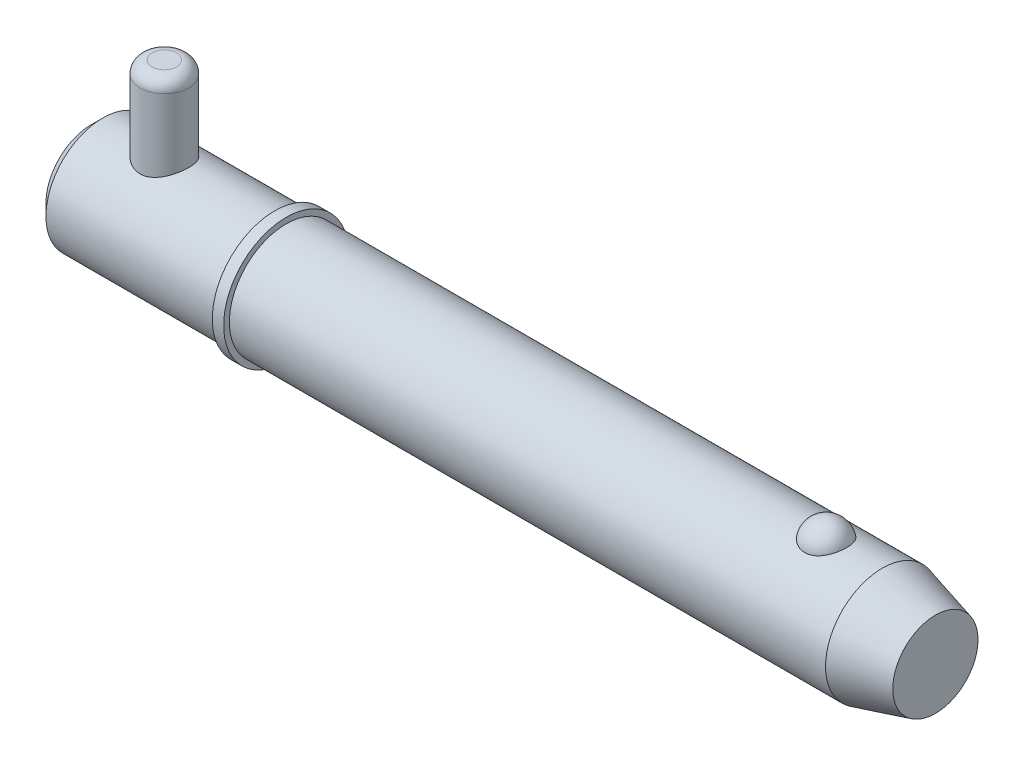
ISO-10303-21;
HEADER;
FILE_DESCRIPTION(('STEP AP214'),'2;1');
FILE_NAME('part.step','',(''),(''),'','','');
FILE_SCHEMA(('AUTOMOTIVE_DESIGN { 1 0 10303 214 1 1 1 1 }'));
ENDSEC;
DATA;
#1=APPLICATION_CONTEXT('core data for automotive mechanical design processes');
#2=APPLICATION_PROTOCOL_DEFINITION('international standard','automotive_design',2000,#1);
#3=PRODUCT_CONTEXT('',#1,'mechanical');
#4=PRODUCT('Part','Part','',(#3));
#5=PRODUCT_RELATED_PRODUCT_CATEGORY('part','',(#4));
#6=PRODUCT_DEFINITION_FORMATION('','',#4);
#7=PRODUCT_DEFINITION_CONTEXT('part definition',#1,'design');
#8=PRODUCT_DEFINITION('design','',#6,#7);
#9=PRODUCT_DEFINITION_SHAPE('','',#8);
#10=(LENGTH_UNIT() NAMED_UNIT(*) SI_UNIT(.MILLI.,.METRE.));
#11=(NAMED_UNIT(*) PLANE_ANGLE_UNIT() SI_UNIT($,.RADIAN.));
#12=(NAMED_UNIT(*) SI_UNIT($,.STERADIAN.) SOLID_ANGLE_UNIT());
#13=UNCERTAINTY_MEASURE_WITH_UNIT(LENGTH_MEASURE(1.E-05),#10,'distance_accuracy_value','');
#14=(GEOMETRIC_REPRESENTATION_CONTEXT(3) GLOBAL_UNCERTAINTY_ASSIGNED_CONTEXT((#13)) GLOBAL_UNIT_ASSIGNED_CONTEXT((#10,
#11,#12)) REPRESENTATION_CONTEXT('',''));
#15=CARTESIAN_POINT('',(0.,0.,0.));
#16=DIRECTION('',(0.,0.,1.));
#17=DIRECTION('',(1.,0.,0.));
#18=AXIS2_PLACEMENT_3D('',#15,#16,#17);
#19=CARTESIAN_POINT('',(14.28,26.985,0.));
#20=DIRECTION('',(0.,-1.,0.));
#21=DIRECTION('',(0.,0.,-1.));
#22=AXIS2_PLACEMENT_3D('',#19,#20,#21);
#23=CYLINDRICAL_SURFACE('',#22,4.76);
#24=CARTESIAN_POINT('',(14.28,-8.73500000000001,0.));
#25=DIRECTION('',(0.,1.,0.));
#26=DIRECTION('',(0.,0.,1.));
#27=AXIS2_PLACEMENT_3D('',#24,#25,#26);
#28=CIRCLE('',#27,4.76);
#29=CARTESIAN_POINT('',(14.28,-8.73500000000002,-4.76));
#30=VERTEX_POINT('',#29);
#31=EDGE_CURVE('P0_E25',#30,#30,#28,.T.);
#32=CARTESIAN_POINT('',(14.28,24.605,0.));
#33=DIRECTION('',(0.,1.,0.));
#34=DIRECTION('',(0.,0.,1.));
#35=AXIS2_PLACEMENT_3D('',#32,#33,#34);
#36=CIRCLE('',#35,4.76);
#37=CARTESIAN_POINT('',(14.28,24.605,-4.76));
#38=VERTEX_POINT('',#37);
#39=EDGE_CURVE('P0_E29',#38,#38,#36,.F.);
#40=CARTESIAN_POINT('',(14.28,-8.73500000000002,-4.76));
#41=CARTESIAN_POINT('',(14.28,-8.38770833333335,-4.76));
#42=CARTESIAN_POINT('',(14.28,-8.04041666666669,-4.76));
#43=CARTESIAN_POINT('',(14.28,-7.34583333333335,-4.76));
#44=CARTESIAN_POINT('',(14.28,-6.99854166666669,-4.76));
#45=CARTESIAN_POINT('',(14.28,-6.30395833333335,-4.76));
#46=CARTESIAN_POINT('',(14.28,-5.95666666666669,-4.76));
#47=CARTESIAN_POINT('',(14.28,-5.26208333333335,-4.76));
#48=CARTESIAN_POINT('',(14.28,-4.91479166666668,-4.76));
#49=CARTESIAN_POINT('',(14.28,-4.22020833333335,-4.76));
#50=CARTESIAN_POINT('',(14.28,-3.87291666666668,-4.76));
#51=CARTESIAN_POINT('',(14.28,-3.17833333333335,-4.76));
#52=CARTESIAN_POINT('',(14.28,-2.83104166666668,-4.76));
#53=CARTESIAN_POINT('',(14.28,-2.13645833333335,-4.76));
#54=CARTESIAN_POINT('',(14.28,-1.78916666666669,-4.76));
#55=CARTESIAN_POINT('',(14.28,-1.09458333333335,-4.76));
#56=CARTESIAN_POINT('',(14.28,-0.747291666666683,-4.76));
#57=CARTESIAN_POINT('',(14.28,-0.052708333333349,-4.76));
#58=CARTESIAN_POINT('',(14.28,0.294583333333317,-4.76));
#59=CARTESIAN_POINT('',(14.28,0.989166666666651,-4.76));
#60=CARTESIAN_POINT('',(14.28,1.33645833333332,-4.76));
#61=CARTESIAN_POINT('',(14.28,2.03104166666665,-4.76));
#62=CARTESIAN_POINT('',(14.28,2.37833333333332,-4.76));
#63=CARTESIAN_POINT('',(14.28,3.07291666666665,-4.76));
#64=CARTESIAN_POINT('',(14.28,3.42020833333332,-4.76));
#65=CARTESIAN_POINT('',(14.28,4.11479166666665,-4.76));
#66=CARTESIAN_POINT('',(14.28,4.46208333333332,-4.76));
#67=CARTESIAN_POINT('',(14.28,5.15666666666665,-4.76));
#68=CARTESIAN_POINT('',(14.28,5.50395833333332,-4.76));
#69=CARTESIAN_POINT('',(14.28,6.19854166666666,-4.76));
#70=CARTESIAN_POINT('',(14.28,6.54583333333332,-4.76));
#71=CARTESIAN_POINT('',(14.28,7.24041666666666,-4.76));
#72=CARTESIAN_POINT('',(14.28,7.58770833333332,-4.76));
#73=CARTESIAN_POINT('',(14.28,8.28229166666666,-4.76));
#74=CARTESIAN_POINT('',(14.28,8.62958333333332,-4.76));
#75=CARTESIAN_POINT('',(14.28,9.32416666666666,-4.76));
#76=CARTESIAN_POINT('',(14.28,9.67145833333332,-4.76));
#77=CARTESIAN_POINT('',(14.28,10.3660416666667,-4.76));
#78=CARTESIAN_POINT('',(14.28,10.7133333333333,-4.76));
#79=CARTESIAN_POINT('',(14.28,11.4079166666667,-4.76));
#80=CARTESIAN_POINT('',(14.28,11.7552083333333,-4.76));
#81=CARTESIAN_POINT('',(14.28,12.4497916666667,-4.76));
#82=CARTESIAN_POINT('',(14.28,12.7970833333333,-4.76));
#83=CARTESIAN_POINT('',(14.28,13.4916666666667,-4.76));
#84=CARTESIAN_POINT('',(14.28,13.8389583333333,-4.76));
#85=CARTESIAN_POINT('',(14.28,14.5335416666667,-4.76));
#86=CARTESIAN_POINT('',(14.28,14.8808333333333,-4.76));
#87=CARTESIAN_POINT('',(14.28,15.5754166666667,-4.76));
#88=CARTESIAN_POINT('',(14.28,15.9227083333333,-4.76));
#89=CARTESIAN_POINT('',(14.28,16.6172916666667,-4.76));
#90=CARTESIAN_POINT('',(14.28,16.9645833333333,-4.76));
#91=CARTESIAN_POINT('',(14.28,17.6591666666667,-4.76));
#92=CARTESIAN_POINT('',(14.28,18.0064583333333,-4.76));
#93=CARTESIAN_POINT('',(14.28,18.7010416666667,-4.76));
#94=CARTESIAN_POINT('',(14.28,19.0483333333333,-4.76));
#95=CARTESIAN_POINT('',(14.28,19.7429166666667,-4.76));
#96=CARTESIAN_POINT('',(14.28,20.0902083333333,-4.76));
#97=CARTESIAN_POINT('',(14.28,20.7847916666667,-4.76));
#98=CARTESIAN_POINT('',(14.28,21.1320833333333,-4.76));
#99=CARTESIAN_POINT('',(14.28,21.8266666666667,-4.76));
#100=CARTESIAN_POINT('',(14.28,22.1739583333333,-4.76));
#101=CARTESIAN_POINT('',(14.28,22.8685416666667,-4.76));
#102=CARTESIAN_POINT('',(14.28,23.2158333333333,-4.76));
#103=CARTESIAN_POINT('',(14.28,23.9104166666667,-4.76));
#104=CARTESIAN_POINT('',(14.28,24.2577083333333,-4.76));
#105=CARTESIAN_POINT('',(14.28,24.605,-4.76));
#106=B_SPLINE_CURVE_WITH_KNOTS('',3,(#40,#41,#42,#43,#44,#45,#46,#47,#48,#49,#50,#51,#52,#53,
#54,#55,#56,#57,#58,#59,#60,#61,#62,#63,#64,#65,#66,#67,#68,#69,#70,#71,#72,#73,#74,#75,#76,#77,
#78,#79,#80,#81,#82,#83,#84,#85,#86,#87,#88,#89,#90,#91,#92,#93,#94,#95,#96,#97,#98,#99,#100,
#101,#102,#103,#104,#105),.UNSPECIFIED.,.F.,.F.,(4,2,2,2,2,2,2,2,2,2,2,2,2,2,2,2,2,2,2,2,2,2,2,
2,2,2,2,2,2,2,2,2,4),(0.,1.041875,2.08375,3.125625,4.1675,5.209375,6.25125,7.293125,
8.33500000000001,9.376875,10.41875,11.460625,12.5025,13.544375,14.58625,15.628125,16.67,
17.711875,18.75375,19.795625,20.8375,21.879375,22.92125,23.963125,25.005,26.046875,27.08875,
28.130625,29.1725,30.214375,31.25625,32.298125,33.34),.UNSPECIFIED.);
#107=EDGE_CURVE('P0_BSEAM14',#30,#38,#106,.T.);
#108=ORIENTED_EDGE('',*,*,#31,.T.);
#109=ORIENTED_EDGE('',*,*,#39,.T.);
#110=ORIENTED_EDGE('',*,*,#107,.T.);
#111=ORIENTED_EDGE('',*,*,#107,.F.);
#112=EDGE_LOOP('',(#108,#110,#109,#111));
#113=FACE_BOUND('',#112,.T.);
#114=ADVANCED_FACE('P0_F14',(#113),#23,.T.);
#115=CARTESIAN_POINT('',(14.28,26.985,0.));
#116=DIRECTION('',(0.,1.,0.));
#117=DIRECTION('',(0.,0.,1.));
#118=AXIS2_PLACEMENT_3D('',#115,#116,#117);
#119=PLANE('',#118);
#120=CARTESIAN_POINT('',(14.28,26.985,0.));
#121=DIRECTION('',(0.,1.,0.));
#122=DIRECTION('',(0.,0.,1.));
#123=AXIS2_PLACEMENT_3D('',#120,#121,#122);
#124=CIRCLE('',#123,2.38);
#125=CARTESIAN_POINT('',(14.28,26.985,2.38));
#126=VERTEX_POINT('',#125);
#127=EDGE_CURVE('P0_E10',#126,#126,#124,.T.);
#128=ORIENTED_EDGE('',*,*,#127,.T.);
#129=EDGE_LOOP('',(#128));
#130=FACE_BOUND('',#129,.T.);
#131=ADVANCED_FACE('P0_F46',(#130),#119,.T.);
#132=CARTESIAN_POINT('',(14.28,-11.115,0.));
#133=DIRECTION('',(0.,1.,0.));
#134=DIRECTION('',(0.,0.,1.));
#135=AXIS2_PLACEMENT_3D('',#132,#133,#134);
#136=PLANE('',#135);
#137=CARTESIAN_POINT('',(14.28,-11.115,0.));
#138=DIRECTION('',(0.,1.,0.));
#139=DIRECTION('',(0.,0.,1.));
#140=AXIS2_PLACEMENT_3D('',#137,#138,#139);
#141=CIRCLE('',#140,2.38);
#142=CARTESIAN_POINT('',(14.28,-11.115,2.38));
#143=VERTEX_POINT('',#142);
#144=EDGE_CURVE('P0_E21',#143,#143,#141,.F.);
#145=ORIENTED_EDGE('',*,*,#144,.T.);
#146=EDGE_LOOP('',(#145));
#147=FACE_BOUND('',#146,.T.);
#148=ADVANCED_FACE('P0_F43',(#147),#136,.F.);
#149=CARTESIAN_POINT('',(14.28,-8.735,0.));
#150=DIRECTION('',(0.,1.,0.));
#151=DIRECTION('',(0.,0.,1.));
#152=AXIS2_PLACEMENT_3D('',#149,#150,#151);
#153=DEGENERATE_TOROIDAL_SURFACE('',#152,2.38,2.38,.T.);
#154=ORIENTED_EDGE('',*,*,#144,.F.);
#155=EDGE_LOOP('',(#154));
#156=FACE_BOUND('',#155,.T.);
#157=ORIENTED_EDGE('',*,*,#31,.F.);
#158=EDGE_LOOP('',(#157));
#159=FACE_BOUND('',#158,.T.);
#160=ADVANCED_FACE('P0_F38',(#156,#159),#153,.T.);
#161=CARTESIAN_POINT('',(14.28,24.605,0.));
#162=DIRECTION('',(0.,1.,0.));
#163=DIRECTION('',(0.,0.,1.));
#164=AXIS2_PLACEMENT_3D('',#161,#162,#163);
#165=DEGENERATE_TOROIDAL_SURFACE('',#164,2.38,2.38,.T.);
#166=ORIENTED_EDGE('',*,*,#39,.F.);
#167=EDGE_LOOP('',(#166));
#168=FACE_BOUND('',#167,.T.);
#169=ORIENTED_EDGE('',*,*,#127,.F.);
#170=EDGE_LOOP('',(#169));
#171=FACE_BOUND('',#170,.T.);
#172=ADVANCED_FACE('P0_F16',(#168,#171),#165,.T.);
#173=CLOSED_SHELL('',(#114,#131,#148,#160,#172));
#174=MANIFOLD_SOLID_BREP('P0_B1',#173);
#175=CARTESIAN_POINT('',(0.,0.,0.));
#176=DIRECTION('',(1.,0.,0.));
#177=DIRECTION('',(0.,0.,-1.));
#178=AXIS2_PLACEMENT_3D('',#175,#176,#177);
#179=CYLINDRICAL_SURFACE('',#178,11.115);
#180=CARTESIAN_POINT('',(154.729563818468,0.,0.));
#181=DIRECTION('',(1.,0.,0.));
#182=DIRECTION('',(0.,0.,-1.));
#183=AXIS2_PLACEMENT_3D('',#180,#181,#182);
#184=CIRCLE('',#183,11.115);
#185=CARTESIAN_POINT('',(154.729563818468,0.,-11.115));
#186=VERTEX_POINT('',#185);
#187=EDGE_CURVE('P1_E81',#186,#186,#184,.T.);
#188=ORIENTED_EDGE('',*,*,#187,.F.);
#189=EDGE_LOOP('',(#188));
#190=FACE_BOUND('',#189,.T.);
#191=CARTESIAN_POINT('',(38.1,0.,0.));
#192=DIRECTION('',(1.,0.,0.));
#193=DIRECTION('',(0.,0.,-1.));
#194=AXIS2_PLACEMENT_3D('',#191,#192,#193);
#195=CIRCLE('',#194,11.115);
#196=CARTESIAN_POINT('',(38.1,0.,-11.115));
#197=VERTEX_POINT('',#196);
#198=EDGE_CURVE('P1_E85',#197,#197,#195,.T.);
#199=ORIENTED_EDGE('',*,*,#198,.T.);
#200=EDGE_LOOP('',(#199));
#201=FACE_BOUND('',#200,.T.);
#202=CARTESIAN_POINT('',(143.731068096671,10.3028087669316,4.17077409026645));
#203=CARTESIAN_POINT('',(143.514775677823,10.3028003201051,4.17078240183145));
#204=CARTESIAN_POINT('',(143.298548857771,10.3098895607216,4.15340593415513));
#205=CARTESIAN_POINT('',(142.872540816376,10.3373834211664,4.08449540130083));
#206=CARTESIAN_POINT('',(142.662757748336,10.3577841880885,4.0329712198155));
#207=CARTESIAN_POINT('',(142.255782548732,10.4095237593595,3.89746513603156));
#208=CARTESIAN_POINT('',(142.058572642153,10.4408466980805,3.81353029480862));
#209=CARTESIAN_POINT('',(141.681338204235,10.5110236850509,3.61560339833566));
#210=CARTESIAN_POINT('',(141.501317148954,10.5498792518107,3.50160528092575));
#211=CARTESIAN_POINT('',(141.157684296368,10.6322884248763,3.24292464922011));
#212=CARTESIAN_POINT('',(140.994686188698,10.6759443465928,3.09746040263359));
#213=CARTESIAN_POINT('',(140.694591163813,10.7625291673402,2.7817192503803));
#214=CARTESIAN_POINT('',(140.557499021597,10.8054579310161,2.61143778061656));
#215=CARTESIAN_POINT('',(140.306408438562,10.8881935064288,2.24226695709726));
#216=CARTESIAN_POINT('',(140.193710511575,10.9277761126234,2.04244123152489));
#217=CARTESIAN_POINT('',(140.001777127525,10.997484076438,1.62578254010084));
#218=CARTESIAN_POINT('',(139.922544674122,11.0276085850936,1.40894804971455));
#219=CARTESIAN_POINT('',(139.798303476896,11.0756732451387,0.961250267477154));
#220=CARTESIAN_POINT('',(139.753760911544,11.0934470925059,0.730239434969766));
#221=CARTESIAN_POINT('',(139.701569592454,11.1143331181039,0.263439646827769));
#222=CARTESIAN_POINT('',(139.693920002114,11.1174456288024,0.027650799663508));
#223=CARTESIAN_POINT('',(139.71561056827,11.1087161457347,-0.440729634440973));
#224=CARTESIAN_POINT('',(139.744762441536,11.0969502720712,-0.6733313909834));
#225=CARTESIAN_POINT('',(139.839143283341,11.0597872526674,-1.12996621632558));
#226=CARTESIAN_POINT('',(139.904372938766,11.0343898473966,-1.35399912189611));
#227=CARTESIAN_POINT('',(140.06969844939,10.972515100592,-1.78750286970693));
#228=CARTESIAN_POINT('',(140.16983863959,10.9360236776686,-1.99695478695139));
#229=CARTESIAN_POINT('',(140.402940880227,10.8557595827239,-2.3952066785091));
#230=CARTESIAN_POINT('',(140.535905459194,10.8119863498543,-2.5840050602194));
#231=CARTESIAN_POINT('',(140.832407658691,10.7216733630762,-2.93635726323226));
#232=CARTESIAN_POINT('',(140.996056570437,10.675123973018,-3.09981510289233));
#233=CARTESIAN_POINT('',(141.349860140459,10.5846571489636,-3.39592247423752));
#234=CARTESIAN_POINT('',(141.540012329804,10.5407394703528,-3.52857487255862));
#235=CARTESIAN_POINT('',(141.93750141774,10.4616690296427,-3.75646057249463));
#236=CARTESIAN_POINT('',(142.14436705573,10.4263443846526,-3.85245432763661));
#237=CARTESIAN_POINT('',(142.572954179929,10.3675574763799,-4.00798747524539));
#238=CARTESIAN_POINT('',(142.794670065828,10.344090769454,-4.0675405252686));
#239=CARTESIAN_POINT('',(143.234669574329,10.3128282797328,-4.14614314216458));
#240=CARTESIAN_POINT('',(143.452565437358,10.3043040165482,-4.1670783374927));
#241=CARTESIAN_POINT('',(143.88894951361,10.3016771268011,-4.17357158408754));
#242=CARTESIAN_POINT('',(144.107437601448,10.3075716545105,-4.15913661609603));
#243=CARTESIAN_POINT('',(144.531744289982,10.3326686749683,-4.09636961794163));
#244=CARTESIAN_POINT('',(144.737745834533,10.3514555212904,-4.0490957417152));
#245=CARTESIAN_POINT('',(145.138576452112,10.399818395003,-3.92320197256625));
#246=CARTESIAN_POINT('',(145.3334046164,10.4293952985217,-3.84457953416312));
#247=CARTESIAN_POINT('',(145.711191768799,10.4969600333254,-3.65612410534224));
#248=CARTESIAN_POINT('',(145.893797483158,10.5351178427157,-3.54564545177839));
#249=CARTESIAN_POINT('',(146.238204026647,10.6154999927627,-3.29718036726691));
#250=CARTESIAN_POINT('',(146.400000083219,10.657725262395,-3.15918764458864));
#251=CARTESIAN_POINT('',(146.706959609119,10.744212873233,-2.85163580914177));
#252=CARTESIAN_POINT('',(146.850891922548,10.7884718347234,-2.68084605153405));
#253=CARTESIAN_POINT('',(147.109237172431,10.872374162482,-2.31721864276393));
#254=CARTESIAN_POINT('',(147.223644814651,10.9120167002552,-2.12437704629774));
#255=CARTESIAN_POINT('',(147.423873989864,10.9838919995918,-1.71516999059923));
#256=CARTESIAN_POINT('',(147.50866178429,11.0158465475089,-1.49824866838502));
#257=CARTESIAN_POINT('',(147.64268382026,11.0673523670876,-1.05228572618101));
#258=CARTESIAN_POINT('',(147.691917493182,11.086903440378,-0.823243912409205));
#259=CARTESIAN_POINT('',(147.753891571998,11.1116323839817,-0.359087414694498));
#260=CARTESIAN_POINT('',(147.766566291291,11.1167843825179,-0.12396256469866));
#261=CARTESIAN_POINT('',(147.754973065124,11.1121144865,0.345220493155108));
#262=CARTESIAN_POINT('',(147.730705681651,11.1022928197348,0.579278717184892));
#263=CARTESIAN_POINT('',(147.645907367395,11.0687504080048,1.03866534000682));
#264=CARTESIAN_POINT('',(147.585529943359,11.0450885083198,1.26402641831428));
#265=CARTESIAN_POINT('',(147.429853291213,10.9863185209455,1.70076772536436));
#266=CARTESIAN_POINT('',(147.334551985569,10.9512097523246,1.91214712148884));
#267=CARTESIAN_POINT('',(147.110397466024,10.8729733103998,2.316083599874));
#268=CARTESIAN_POINT('',(146.981380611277,10.8298068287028,2.50854240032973));
#269=CARTESIAN_POINT('',(146.692732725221,10.7401896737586,2.86808766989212));
#270=CARTESIAN_POINT('',(146.533102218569,10.6937390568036,3.03517457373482));
#271=CARTESIAN_POINT('',(146.187534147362,10.6029321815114,3.33857581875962));
#272=CARTESIAN_POINT('',(146.001708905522,10.5585680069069,3.47501541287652));
#273=CARTESIAN_POINT('',(145.607875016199,10.4769321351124,3.71390897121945));
#274=CARTESIAN_POINT('',(145.399863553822,10.439661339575,3.81635861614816));
#275=CARTESIAN_POINT('',(144.954066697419,10.3749407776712,3.98910631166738));
#276=CARTESIAN_POINT('',(144.715234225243,10.3482457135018,4.05700929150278));
#277=CARTESIAN_POINT('',(144.227925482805,10.312188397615,4.14782844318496));
#278=CARTESIAN_POINT('',(143.979453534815,10.3028184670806,4.17076454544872));
#279=CARTESIAN_POINT('',(143.731068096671,10.3028087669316,4.17077409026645));
#280=B_SPLINE_CURVE_WITH_KNOTS('',3,(#202,#203,#204,#205,#206,#207,#208,#209,#210,#211,#212,
#213,#214,#215,#216,#217,#218,#219,#220,#221,#222,#223,#224,#225,#226,#227,#228,#229,#230,#231,
#232,#233,#234,#235,#236,#237,#238,#239,#240,#241,#242,#243,#244,#245,#246,#247,#248,#249,#250,
#251,#252,#253,#254,#255,#256,#257,#258,#259,#260,#261,#262,#263,#264,#265,#266,#267,#268,#269,
#270,#271,#272,#273,#274,#275,#276,#277,#278,#279),.UNSPECIFIED.,.T.,.F.,(4,2,2,2,2,2,2,2,2,2,2,
2,2,2,2,2,2,2,2,2,2,2,2,2,2,2,2,2,2,2,2,2,2,2,2,2,2,2,4),(0.,0.64796614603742,1.29574482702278,
1.9425864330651,2.58955857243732,3.25496465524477,3.92049326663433,4.61566368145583,
5.31089647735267,6.01531821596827,6.71972398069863,7.42054043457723,8.12137023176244,
8.82309331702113,9.5248704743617,10.2292439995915,10.9335519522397,11.6223330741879,
12.3108558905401,12.9647664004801,13.6185478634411,14.252184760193,14.8858731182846,
15.5334360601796,16.1811472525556,16.8611459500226,17.5412664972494,18.2431855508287,
18.9451158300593,19.6483065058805,20.3514864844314,21.0516982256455,21.7519516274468,
22.4556690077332,23.1593743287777,23.860149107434,24.5610129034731,25.3054529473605,
26.049562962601),.UNSPECIFIED.);
#281=CARTESIAN_POINT('',(143.731068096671,10.3028087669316,4.17077409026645));
#282=VERTEX_POINT('',#281);
#283=EDGE_CURVE('P1_E35',#282,#282,#280,.T.);
#284=ORIENTED_EDGE('',*,*,#283,.T.);
#285=EDGE_LOOP('',(#284));
#286=FACE_BOUND('',#285,.T.);
#287=ADVANCED_FACE('P1_F13',(#190,#201,#286),#179,.T.);
#288=CARTESIAN_POINT('',(0.,0.,0.));
#289=DIRECTION('',(-1.,0.,0.));
#290=DIRECTION('',(0.,0.,1.));
#291=AXIS2_PLACEMENT_3D('',#288,#289,#290);
#292=PLANE('',#291);
#293=CARTESIAN_POINT('',(0.,0.,0.));
#294=DIRECTION('',(1.,0.,0.));
#295=DIRECTION('',(0.,0.,-1.));
#296=AXIS2_PLACEMENT_3D('',#293,#294,#295);
#297=CIRCLE('',#296,8.892);
#298=CARTESIAN_POINT('',(0.,0.,-8.892));
#299=VERTEX_POINT('',#298);
#300=EDGE_CURVE('P1_E9',#299,#299,#297,.T.);
#301=ORIENTED_EDGE('',*,*,#300,.F.);
#302=EDGE_LOOP('',(#301));
#303=FACE_BOUND('',#302,.T.);
#304=ADVANCED_FACE('P1_F15',(#303),#292,.T.);
#305=CARTESIAN_POINT('',(2.22299999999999,0.,0.));
#306=DIRECTION('',(1.,0.,0.));
#307=DIRECTION('',(0.,0.,-1.));
#308=AXIS2_PLACEMENT_3D('',#305,#306,#307);
#309=CONICAL_SURFACE('',#308,11.115,0.78539816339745);
#310=ORIENTED_EDGE('',*,*,#300,.T.);
#311=EDGE_LOOP('',(#310));
#312=FACE_BOUND('',#311,.T.);
#313=CARTESIAN_POINT('',(2.22299999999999,0.,0.));
#314=DIRECTION('',(1.,0.,0.));
#315=DIRECTION('',(0.,0.,-1.));
#316=AXIS2_PLACEMENT_3D('',#313,#314,#315);
#317=CIRCLE('',#316,11.115);
#318=CARTESIAN_POINT('',(2.22299999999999,0.,-11.115));
#319=VERTEX_POINT('',#318);
#320=EDGE_CURVE('P1_E26',#319,#319,#317,.T.);
#321=ORIENTED_EDGE('',*,*,#320,.F.);
#322=EDGE_LOOP('',(#321));
#323=FACE_BOUND('',#322,.T.);
#324=ADVANCED_FACE('P1_F77',(#312,#323),#309,.T.);
#325=CARTESIAN_POINT('',(0.,0.,0.));
#326=DIRECTION('',(1.,0.,0.));
#327=DIRECTION('',(0.,0.,-1.));
#328=AXIS2_PLACEMENT_3D('',#325,#326,#327);
#329=CYLINDRICAL_SURFACE('',#328,11.115);
#330=CARTESIAN_POINT('',(14.28,-10.0441836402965,4.76));
#331=CARTESIAN_POINT('',(14.1533731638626,-10.0441846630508,4.75999904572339));
#332=CARTESIAN_POINT('',(14.0267055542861,-10.0465865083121,4.75493985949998));
#333=CARTESIAN_POINT('',(13.774298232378,-10.0561141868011,4.73475585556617));
#334=CARTESIAN_POINT('',(13.6485591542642,-10.0632429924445,4.71962470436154));
#335=CARTESIAN_POINT('',(13.3987500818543,-10.0819979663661,4.67942666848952));
#336=CARTESIAN_POINT('',(13.2746840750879,-10.0936334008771,4.65433930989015));
#337=CARTESIAN_POINT('',(13.0293244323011,-10.1210146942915,4.59449317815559));
#338=CARTESIAN_POINT('',(12.9080319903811,-10.1367622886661,4.55973032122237));
#339=CARTESIAN_POINT('',(12.669614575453,-10.1717810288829,4.48106435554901));
#340=CARTESIAN_POINT('',(12.5524727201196,-10.1910352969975,4.4372048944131));
#341=CARTESIAN_POINT('',(12.3224300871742,-10.2325403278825,4.34063417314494));
#342=CARTESIAN_POINT('',(12.2095309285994,-10.2547922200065,4.28791957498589));
#343=CARTESIAN_POINT('',(11.8782785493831,-10.3250879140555,4.11715127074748));
#344=CARTESIAN_POINT('',(11.6670799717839,-10.3767168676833,3.98637638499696));
#345=CARTESIAN_POINT('',(11.2564039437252,-10.4874309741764,3.68567149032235));
#346=CARTESIAN_POINT('',(11.0583793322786,-10.5467772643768,3.51386978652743));
#347=CARTESIAN_POINT('',(10.6927724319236,-10.6641377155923,3.13969960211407));
#348=CARTESIAN_POINT('',(10.5252022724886,-10.7221513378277,2.93731900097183));
#349=CARTESIAN_POINT('',(10.2965609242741,-10.8050020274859,2.60935726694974));
#350=CARTESIAN_POINT('',(10.2227768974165,-10.8324811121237,2.49310321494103));
#351=CARTESIAN_POINT('',(10.0853380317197,-10.884703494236,2.25418999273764));
#352=CARTESIAN_POINT('',(10.0216789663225,-10.9094479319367,2.13153352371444));
#353=CARTESIAN_POINT('',(9.90506238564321,-10.9554932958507,1.88060370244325));
#354=CARTESIAN_POINT('',(9.85210574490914,-10.9767939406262,1.7523298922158));
#355=CARTESIAN_POINT('',(9.75746464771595,-11.0153112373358,1.49115740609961));
#356=CARTESIAN_POINT('',(9.71577447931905,-11.0325299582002,1.35826111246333));
#357=CARTESIAN_POINT('',(9.64605475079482,-11.0615607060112,1.09614539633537));
#358=CARTESIAN_POINT('',(9.61740732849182,-11.0736151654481,0.96711700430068));
#359=CARTESIAN_POINT('',(9.57092026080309,-11.0932687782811,0.706847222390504));
#360=CARTESIAN_POINT('',(9.55307574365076,-11.1008699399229,0.575606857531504));
#361=CARTESIAN_POINT('',(9.52838640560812,-11.1114054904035,0.31192917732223));
#362=CARTESIAN_POINT('',(9.52153986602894,-11.114340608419,0.179492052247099));
#363=CARTESIAN_POINT('',(9.51892405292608,-11.1154607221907,-0.0855090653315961));
#364=CARTESIAN_POINT('',(9.52315432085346,-11.1136459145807,-0.218073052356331));
#365=CARTESIAN_POINT('',(9.542009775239,-11.1055891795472,-0.473709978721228));
#366=CARTESIAN_POINT('',(9.55594693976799,-11.099640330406,-0.596843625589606));
#367=CARTESIAN_POINT('',(9.59332832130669,-11.0837823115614,-0.841440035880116));
#368=CARTESIAN_POINT('',(9.61677567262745,-11.0738718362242,-0.962902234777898));
#369=CARTESIAN_POINT('',(9.67294089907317,-11.0503378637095,-1.20325684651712));
#370=CARTESIAN_POINT('',(9.70565569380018,-11.0367156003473,-1.32215009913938));
#371=CARTESIAN_POINT('',(9.78005008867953,-11.0060908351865,-1.55666640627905));
#372=CARTESIAN_POINT('',(9.82173311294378,-10.9890870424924,-1.67228819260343));
#373=CARTESIAN_POINT('',(9.96110379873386,-10.9330280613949,-2.01656166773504));
#374=CARTESIAN_POINT('',(10.0722987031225,-10.8892801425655,-2.23915547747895));
#375=CARTESIAN_POINT('',(10.3268588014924,-10.7934745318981,-2.66299199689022));
#376=CARTESIAN_POINT('',(10.4702355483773,-10.7414138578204,-2.86422700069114));
#377=CARTESIAN_POINT('',(10.7973904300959,-10.6296201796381,-3.25557775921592));
#378=CARTESIAN_POINT('',(10.9833705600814,-10.569604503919,-3.443774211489));
#379=CARTESIAN_POINT('',(11.3844486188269,-10.4514707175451,-3.78722133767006));
#380=CARTESIAN_POINT('',(11.5995590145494,-10.3933534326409,-3.94245783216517));
#381=CARTESIAN_POINT('',(11.9444340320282,-10.311516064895,-4.14990014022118));
#382=CARTESIAN_POINT('',(12.0654579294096,-10.2847012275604,-4.21573894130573));
#383=CARTESIAN_POINT('',(12.3132718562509,-10.2342051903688,-4.33688518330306));
#384=CARTESIAN_POINT('',(12.4400593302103,-10.2105226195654,-4.39219723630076));
#385=CARTESIAN_POINT('',(12.6985418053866,-10.1671237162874,-4.49174500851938));
#386=CARTESIAN_POINT('',(12.8302359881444,-10.1474067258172,-4.53598256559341));
#387=CARTESIAN_POINT('',(13.0975061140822,-10.1126841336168,-4.61287629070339));
#388=CARTESIAN_POINT('',(13.233079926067,-10.0976759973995,-4.64553869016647));
#389=CARTESIAN_POINT('',(13.4978553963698,-10.0737863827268,-4.6971059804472));
#390=CARTESIAN_POINT('',(13.6268754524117,-10.0645618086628,-4.716785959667));
#391=CARTESIAN_POINT('',(13.8862990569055,-10.051062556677,-4.74548419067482));
#392=CARTESIAN_POINT('',(14.0167019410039,-10.0467856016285,-4.75450734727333));
#393=CARTESIAN_POINT('',(14.277859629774,-10.0433352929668,-4.76179143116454));
#394=CARTESIAN_POINT('',(14.4086143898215,-10.0441613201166,-4.76005366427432));
#395=CARTESIAN_POINT('',(14.6694025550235,-10.0508838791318,-4.74584231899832));
#396=CARTESIAN_POINT('',(14.7994359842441,-10.0567802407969,-4.73336910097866));
#397=CARTESIAN_POINT('',(15.0487369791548,-10.0728449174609,-4.69907984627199));
#398=CARTESIAN_POINT('',(15.1681238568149,-10.0826872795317,-4.67797462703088));
#399=CARTESIAN_POINT('',(15.4045894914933,-10.1062580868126,-4.62682977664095));
#400=CARTESIAN_POINT('',(15.5216674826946,-10.1199877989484,-4.59678723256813));
#401=CARTESIAN_POINT('',(15.868278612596,-10.1664161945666,-4.49365911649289));
#402=CARTESIAN_POINT('',(16.0933756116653,-10.2043671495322,-4.40754694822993));
#403=CARTESIAN_POINT('',(16.5357981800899,-10.2919879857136,-4.19898201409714));
#404=CARTESIAN_POINT('',(16.7523611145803,-10.3420954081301,-4.07511281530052));
#405=CARTESIAN_POINT('',(17.1627188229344,-10.4477911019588,-3.7959429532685));
#406=CARTESIAN_POINT('',(17.3565033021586,-10.5033818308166,-3.64062816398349));
#407=CARTESIAN_POINT('',(17.7334034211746,-10.6196376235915,-3.28693729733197));
#408=CARTESIAN_POINT('',(17.9141276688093,-10.6803237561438,-3.08599175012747));
#409=CARTESIAN_POINT('',(18.1582189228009,-10.7666348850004,-2.76320365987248));
#410=CARTESIAN_POINT('',(18.2351223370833,-10.7946346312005,-2.65197124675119));
#411=CARTESIAN_POINT('',(18.3793967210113,-10.8483267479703,-2.42297927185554));
#412=CARTESIAN_POINT('',(18.4467718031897,-10.87402011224,-2.30522255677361));
#413=CARTESIAN_POINT('',(18.5717669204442,-10.9225249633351,-2.06324665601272));
#414=CARTESIAN_POINT('',(18.6293326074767,-10.9453202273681,-1.93899615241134));
#415=CARTESIAN_POINT('',(18.73370006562,-10.9872100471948,-1.6855059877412));
#416=CARTESIAN_POINT('',(18.7805065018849,-11.0063062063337,-1.55626851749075));
#417=CARTESIAN_POINT('',(18.8628731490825,-11.0402419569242,-1.29375150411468));
#418=CARTESIAN_POINT('',(18.8984366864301,-11.0550828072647,-1.16047316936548));
#419=CARTESIAN_POINT('',(18.9579183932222,-11.0800638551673,-0.890912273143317));
#420=CARTESIAN_POINT('',(18.9818374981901,-11.0902044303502,-0.75462995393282));
#421=CARTESIAN_POINT('',(19.0164177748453,-11.104911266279,-0.490295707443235));
#422=CARTESIAN_POINT('',(19.027922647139,-11.1098318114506,-0.362373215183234));
#423=CARTESIAN_POINT('',(19.040554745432,-11.1152360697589,-0.105876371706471));
#424=CARTESIAN_POINT('',(19.0416784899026,-11.1157182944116,0.0226981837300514));
#425=CARTESIAN_POINT('',(19.0335275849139,-11.1122291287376,0.27938352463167));
#426=CARTESIAN_POINT('',(19.0242587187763,-11.1082602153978,0.407494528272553));
#427=CARTESIAN_POINT('',(18.9954320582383,-11.0959792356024,0.662388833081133));
#428=CARTESIAN_POINT('',(18.9758704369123,-11.0876655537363,0.789171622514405));
#429=CARTESIAN_POINT('',(18.9276379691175,-11.0673259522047,1.03545890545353));
#430=CARTESIAN_POINT('',(18.8993573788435,-11.0554596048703,1.15505309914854));
#431=CARTESIAN_POINT('',(18.8337694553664,-11.0282166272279,1.39134516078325));
#432=CARTESIAN_POINT('',(18.7964589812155,-11.0128387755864,1.5080420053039));
#433=CARTESIAN_POINT('',(18.671464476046,-10.9619666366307,1.85262797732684));
#434=CARTESIAN_POINT('',(18.5706772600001,-10.9217161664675,2.07521484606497));
#435=CARTESIAN_POINT('',(18.33202463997,-10.8301378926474,2.51061719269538));
#436=CARTESIAN_POINT('',(18.1926775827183,-10.7783885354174,2.72252375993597));
#437=CARTESIAN_POINT('',(17.8829747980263,-10.669863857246,3.12088015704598));
#438=CARTESIAN_POINT('',(17.7126068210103,-10.6130865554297,3.30731987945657));
#439=CARTESIAN_POINT('',(17.3310036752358,-10.495668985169,3.66358491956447));
#440=CARTESIAN_POINT('',(17.1177010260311,-10.4350471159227,3.83122543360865));
#441=CARTESIAN_POINT('',(16.7778915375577,-10.3495418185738,4.05420569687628));
#442=CARTESIAN_POINT('',(16.6612023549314,-10.3219229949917,4.12383380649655));
#443=CARTESIAN_POINT('',(16.4218466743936,-10.2693487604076,4.25306463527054));
#444=CARTESIAN_POINT('',(16.2991829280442,-10.2443921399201,4.31267191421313));
#445=CARTESIAN_POINT('',(16.0488008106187,-10.1979981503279,4.42126071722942));
#446=CARTESIAN_POINT('',(15.9210894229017,-10.1765561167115,4.47025635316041));
#447=CARTESIAN_POINT('',(15.6613937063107,-10.1379191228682,4.55720152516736));
#448=CARTESIAN_POINT('',(15.5294115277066,-10.1207220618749,4.59515652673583));
#449=CARTESIAN_POINT('',(15.2624981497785,-10.091252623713,4.65951684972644));
#450=CARTESIAN_POINT('',(15.1275757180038,-10.0789672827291,4.68595259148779));
#451=CARTESIAN_POINT('',(14.8556442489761,-10.0597530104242,4.72706206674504));
#452=CARTESIAN_POINT('',(14.7186368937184,-10.0528199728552,4.74174481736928));
#453=CARTESIAN_POINT('',(14.5310955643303,-10.047196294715,4.75363843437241));
#454=CARTESIAN_POINT('',(14.48091543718,-10.0460674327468,4.75602323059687));
#455=CARTESIAN_POINT('',(14.3804923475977,-10.044560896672,4.7592042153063));
#456=CARTESIAN_POINT('',(14.3302493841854,-10.0441832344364,4.76000037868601));
#457=CARTESIAN_POINT('',(14.28,-10.0441836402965,4.76));
#458=B_SPLINE_CURVE_WITH_KNOTS('',3,(#330,#331,#332,#333,#334,#335,#336,#337,#338,#339,#340,
#341,#342,#343,#344,#345,#346,#347,#348,#349,#350,#351,#352,#353,#354,#355,#356,#357,#358,#359,
#360,#361,#362,#363,#364,#365,#366,#367,#368,#369,#370,#371,#372,#373,#374,#375,#376,#377,#378,
#379,#380,#381,#382,#383,#384,#385,#386,#387,#388,#389,#390,#391,#392,#393,#394,#395,#396,#397,
#398,#399,#400,#401,#402,#403,#404,#405,#406,#407,#408,#409,#410,#411,#412,#413,#414,#415,#416,
#417,#418,#419,#420,#421,#422,#423,#424,#425,#426,#427,#428,#429,#430,#431,#432,#433,#434,#435,
#436,#437,#438,#439,#440,#441,#442,#443,#444,#445,#446,#447,#448,#449,#450,#451,#452,#453,#454,
#455,#456,#457),.UNSPECIFIED.,.T.,.F.,(4,2,2,2,2,2,2,2,2,2,2,2,2,2,2,2,2,2,2,2,2,2,2,2,2,2,2,2,
2,2,2,2,2,2,2,2,2,2,2,2,2,2,2,2,2,2,2,2,2,2,2,2,2,2,2,2,2,2,2,2,2,2,2,4),(0.,0.379828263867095,
0.759895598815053,1.14074858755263,1.52176256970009,1.90098898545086,2.28035867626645,
3.03818035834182,3.84125131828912,4.6446414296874,5.06541657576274,5.48601561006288,
5.90664899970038,6.3270687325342,6.72470503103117,7.12216187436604,7.51955659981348,
7.91693487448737,8.28868404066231,8.66055582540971,9.03230414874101,9.40419465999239,
10.1585834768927,10.9132435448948,11.7236471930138,12.5343987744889,12.9550196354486,
13.3754557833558,13.7958221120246,14.2159617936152,14.6079540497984,14.9997658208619,
15.3915300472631,15.7832811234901,16.1477615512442,16.512360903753,17.240999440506,
18.0012974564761,18.761937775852,19.5886929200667,20.0025782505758,20.4162843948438,
20.832212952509,21.2479608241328,21.6635855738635,22.0791769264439,22.4642880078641,
22.8495282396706,23.2345541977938,23.6197234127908,23.9896813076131,24.3597680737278,
25.099327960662,25.8726239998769,26.6462260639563,27.4759193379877,27.8914891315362,
28.3068693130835,28.7216936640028,29.1363123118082,29.5498292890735,29.9630287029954,
30.113753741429,30.2644811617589),.UNSPECIFIED.);
#459=CARTESIAN_POINT('',(14.28,-10.0441836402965,4.76));
#460=VERTEX_POINT('',#459);
#461=EDGE_CURVE('P1_E17',#460,#460,#458,.T.);
#462=ORIENTED_EDGE('',*,*,#461,.F.);
#463=EDGE_LOOP('',(#462));
#464=FACE_BOUND('',#463,.T.);
#465=CARTESIAN_POINT('',(14.28,10.0441836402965,4.76));
#466=CARTESIAN_POINT('',(14.4066268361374,10.0441846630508,4.75999904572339));
#467=CARTESIAN_POINT('',(14.5332944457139,10.0465865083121,4.75493985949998));
#468=CARTESIAN_POINT('',(14.785701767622,10.0561141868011,4.73475585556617));
#469=CARTESIAN_POINT('',(14.9114408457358,10.0632429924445,4.71962470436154));
#470=CARTESIAN_POINT('',(15.1612499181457,10.0819979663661,4.67942666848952));
#471=CARTESIAN_POINT('',(15.2853159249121,10.0936334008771,4.65433930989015));
#472=CARTESIAN_POINT('',(15.5306755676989,10.1210146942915,4.59449317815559));
#473=CARTESIAN_POINT('',(15.6519680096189,10.1367622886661,4.55973032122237));
#474=CARTESIAN_POINT('',(15.890385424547,10.1717810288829,4.48106435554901));
#475=CARTESIAN_POINT('',(16.0075272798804,10.1910352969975,4.4372048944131));
#476=CARTESIAN_POINT('',(16.2375699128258,10.2325403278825,4.34063417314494));
#477=CARTESIAN_POINT('',(16.3504690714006,10.2547922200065,4.28791957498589));
#478=CARTESIAN_POINT('',(16.6817214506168,10.3250879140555,4.11715127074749));
#479=CARTESIAN_POINT('',(16.8929200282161,10.3767168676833,3.98637638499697));
#480=CARTESIAN_POINT('',(17.3035960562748,10.4874309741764,3.68567149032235));
#481=CARTESIAN_POINT('',(17.5016206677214,10.5467772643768,3.51386978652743));
#482=CARTESIAN_POINT('',(17.8672275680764,10.6641377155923,3.13969960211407));
#483=CARTESIAN_POINT('',(18.0347977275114,10.7221513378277,2.93731900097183));
#484=CARTESIAN_POINT('',(18.2634390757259,10.8050020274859,2.60935726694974));
#485=CARTESIAN_POINT('',(18.3372231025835,10.8324811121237,2.49310321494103));
#486=CARTESIAN_POINT('',(18.4746619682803,10.884703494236,2.25418999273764));
#487=CARTESIAN_POINT('',(18.5383210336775,10.9094479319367,2.13153352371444));
#488=CARTESIAN_POINT('',(18.6549376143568,10.9554932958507,1.88060370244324));
#489=CARTESIAN_POINT('',(18.7078942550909,10.9767939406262,1.75232989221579));
#490=CARTESIAN_POINT('',(18.8025353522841,11.0153112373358,1.4911574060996));
#491=CARTESIAN_POINT('',(18.844225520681,11.0325299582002,1.35826111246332));
#492=CARTESIAN_POINT('',(18.9139452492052,11.0615607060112,1.09614539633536));
#493=CARTESIAN_POINT('',(18.9425926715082,11.0736151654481,0.967117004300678));
#494=CARTESIAN_POINT('',(18.9890797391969,11.0932687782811,0.706847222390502));
#495=CARTESIAN_POINT('',(19.0069242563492,11.1008699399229,0.575606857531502));
#496=CARTESIAN_POINT('',(19.0316135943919,11.1114054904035,0.311929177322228));
#497=CARTESIAN_POINT('',(19.0384601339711,11.114340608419,0.179492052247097));
#498=CARTESIAN_POINT('',(19.0410759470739,11.1154607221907,-0.0855090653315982));
#499=CARTESIAN_POINT('',(19.0368456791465,11.1136459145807,-0.218073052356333));
#500=CARTESIAN_POINT('',(19.017990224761,11.1055891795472,-0.47370997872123));
#501=CARTESIAN_POINT('',(19.004053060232,11.099640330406,-0.596843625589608));
#502=CARTESIAN_POINT('',(18.9666716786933,11.0837823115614,-0.841440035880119));
#503=CARTESIAN_POINT('',(18.9432243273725,11.0738718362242,-0.9629022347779));
#504=CARTESIAN_POINT('',(18.8870591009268,11.0503378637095,-1.20325684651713));
#505=CARTESIAN_POINT('',(18.8543443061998,11.0367156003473,-1.32215009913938));
#506=CARTESIAN_POINT('',(18.7799499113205,11.0060908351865,-1.55666640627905));
#507=CARTESIAN_POINT('',(18.7382668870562,10.9890870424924,-1.67228819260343));
#508=CARTESIAN_POINT('',(18.5988962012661,10.9330280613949,-2.01656166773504));
#509=CARTESIAN_POINT('',(18.4877012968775,10.8892801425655,-2.23915547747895));
#510=CARTESIAN_POINT('',(18.2331411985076,10.7934745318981,-2.66299199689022));
#511=CARTESIAN_POINT('',(18.0897644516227,10.7414138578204,-2.86422700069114));
#512=CARTESIAN_POINT('',(17.7626095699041,10.6296201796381,-3.25557775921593));
#513=CARTESIAN_POINT('',(17.5766294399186,10.569604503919,-3.443774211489));
#514=CARTESIAN_POINT('',(17.1755513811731,10.4514707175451,-3.78722133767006));
#515=CARTESIAN_POINT('',(16.9604409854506,10.3933534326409,-3.94245783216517));
#516=CARTESIAN_POINT('',(16.6155659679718,10.311516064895,-4.14990014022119));
#517=CARTESIAN_POINT('',(16.4945420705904,10.2847012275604,-4.21573894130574));
#518=CARTESIAN_POINT('',(16.2467281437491,10.2342051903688,-4.33688518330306));
#519=CARTESIAN_POINT('',(16.1199406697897,10.2105226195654,-4.39219723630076));
#520=CARTESIAN_POINT('',(15.8614581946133,10.1671237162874,-4.49174500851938));
#521=CARTESIAN_POINT('',(15.7297640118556,10.1474067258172,-4.53598256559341));
#522=CARTESIAN_POINT('',(15.4624938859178,10.1126841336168,-4.61287629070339));
#523=CARTESIAN_POINT('',(15.326920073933,10.0976759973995,-4.64553869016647));
#524=CARTESIAN_POINT('',(15.0621446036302,10.0737863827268,-4.6971059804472));
#525=CARTESIAN_POINT('',(14.9331245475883,10.0645618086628,-4.716785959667));
#526=CARTESIAN_POINT('',(14.6737009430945,10.051062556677,-4.74548419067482));
#527=CARTESIAN_POINT('',(14.543298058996,10.0467856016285,-4.75450734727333));
#528=CARTESIAN_POINT('',(14.2821403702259,10.0433352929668,-4.76179143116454));
#529=CARTESIAN_POINT('',(14.1513856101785,10.0441613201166,-4.76005366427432));
#530=CARTESIAN_POINT('',(13.8905974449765,10.0508838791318,-4.74584231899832));
#531=CARTESIAN_POINT('',(13.7605640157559,10.0567802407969,-4.73336910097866));
#532=CARTESIAN_POINT('',(13.5112630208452,10.0728449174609,-4.69907984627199));
#533=CARTESIAN_POINT('',(13.3918761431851,10.0826872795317,-4.67797462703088));
#534=CARTESIAN_POINT('',(13.1554105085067,10.1062580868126,-4.62682977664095));
#535=CARTESIAN_POINT('',(13.0383325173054,10.1199877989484,-4.59678723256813));
#536=CARTESIAN_POINT('',(12.691721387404,10.1664161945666,-4.49365911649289));
#537=CARTESIAN_POINT('',(12.4666243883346,10.2043671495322,-4.40754694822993));
#538=CARTESIAN_POINT('',(12.0242018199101,10.2919879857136,-4.19898201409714));
#539=CARTESIAN_POINT('',(11.8076388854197,10.3420954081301,-4.07511281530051));
#540=CARTESIAN_POINT('',(11.3972811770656,10.4477911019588,-3.7959429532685));
#541=CARTESIAN_POINT('',(11.2034966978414,10.5033818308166,-3.64062816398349));
#542=CARTESIAN_POINT('',(10.8265965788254,10.6196376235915,-3.28693729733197));
#543=CARTESIAN_POINT('',(10.6458723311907,10.6803237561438,-3.08599175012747));
#544=CARTESIAN_POINT('',(10.4017810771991,10.7666348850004,-2.76320365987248));
#545=CARTESIAN_POINT('',(10.3248776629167,10.7946346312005,-2.65197124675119));
#546=CARTESIAN_POINT('',(10.1806032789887,10.8483267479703,-2.42297927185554));
#547=CARTESIAN_POINT('',(10.1132281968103,10.87402011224,-2.30522255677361));
#548=CARTESIAN_POINT('',(9.98823307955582,10.9225249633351,-2.06324665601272));
#549=CARTESIAN_POINT('',(9.93066739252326,10.9453202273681,-1.93899615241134));
#550=CARTESIAN_POINT('',(9.82629993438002,10.9872100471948,-1.6855059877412));
#551=CARTESIAN_POINT('',(9.77949349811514,11.0063062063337,-1.55626851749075));
#552=CARTESIAN_POINT('',(9.69712685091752,11.0402419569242,-1.29375150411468));
#553=CARTESIAN_POINT('',(9.66156331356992,11.0550828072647,-1.16047316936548));
#554=CARTESIAN_POINT('',(9.60208160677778,11.0800638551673,-0.890912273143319));
#555=CARTESIAN_POINT('',(9.57816250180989,11.0902044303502,-0.754629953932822));
#556=CARTESIAN_POINT('',(9.54358222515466,11.104911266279,-0.490295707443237));
#557=CARTESIAN_POINT('',(9.53207735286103,11.1098318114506,-0.362373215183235));
#558=CARTESIAN_POINT('',(9.51944525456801,11.1152360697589,-0.105876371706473));
#559=CARTESIAN_POINT('',(9.51832151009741,11.1157182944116,0.0226981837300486));
#560=CARTESIAN_POINT('',(9.52647241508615,11.1122291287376,0.279383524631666));
#561=CARTESIAN_POINT('',(9.53574128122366,11.1082602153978,0.407494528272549));
#562=CARTESIAN_POINT('',(9.5645679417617,11.0959792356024,0.662388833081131));
#563=CARTESIAN_POINT('',(9.58412956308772,11.0876655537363,0.789171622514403));
#564=CARTESIAN_POINT('',(9.63236203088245,11.0673259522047,1.03545890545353));
#565=CARTESIAN_POINT('',(9.66064262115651,11.0554596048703,1.15505309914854));
#566=CARTESIAN_POINT('',(9.72623054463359,11.0282166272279,1.39134516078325));
#567=CARTESIAN_POINT('',(9.76354101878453,11.0128387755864,1.5080420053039));
#568=CARTESIAN_POINT('',(9.88853552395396,10.9619666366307,1.85262797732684));
#569=CARTESIAN_POINT('',(9.98932273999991,10.9217161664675,2.07521484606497));
#570=CARTESIAN_POINT('',(10.22797536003,10.8301378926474,2.51061719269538));
#571=CARTESIAN_POINT('',(10.3673224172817,10.7783885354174,2.72252375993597));
#572=CARTESIAN_POINT('',(10.6770252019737,10.669863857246,3.12088015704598));
#573=CARTESIAN_POINT('',(10.8473931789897,10.6130865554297,3.30731987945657));
#574=CARTESIAN_POINT('',(11.2289963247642,10.495668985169,3.66358491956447));
#575=CARTESIAN_POINT('',(11.4422989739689,10.4350471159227,3.83122543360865));
#576=CARTESIAN_POINT('',(11.7821084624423,10.3495418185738,4.05420569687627));
#577=CARTESIAN_POINT('',(11.8987976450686,10.3219229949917,4.12383380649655));
#578=CARTESIAN_POINT('',(12.1381533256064,10.2693487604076,4.25306463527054));
#579=CARTESIAN_POINT('',(12.2608170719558,10.2443921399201,4.31267191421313));
#580=CARTESIAN_POINT('',(12.5111991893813,10.1979981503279,4.42126071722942));
#581=CARTESIAN_POINT('',(12.6389105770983,10.1765561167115,4.47025635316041));
#582=CARTESIAN_POINT('',(12.8986062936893,10.1379191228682,4.55720152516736));
#583=CARTESIAN_POINT('',(13.0305884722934,10.1207220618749,4.59515652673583));
#584=CARTESIAN_POINT('',(13.2975018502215,10.091252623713,4.65951684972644));
#585=CARTESIAN_POINT('',(13.4324242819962,10.0789672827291,4.68595259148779));
#586=CARTESIAN_POINT('',(13.7043557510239,10.0597530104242,4.72706206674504));
#587=CARTESIAN_POINT('',(13.8413631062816,10.0528199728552,4.74174481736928));
#588=CARTESIAN_POINT('',(14.0289044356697,10.047196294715,4.75363843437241));
#589=CARTESIAN_POINT('',(14.07908456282,10.0460674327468,4.75602323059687));
#590=CARTESIAN_POINT('',(14.1795076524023,10.044560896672,4.7592042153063));
#591=CARTESIAN_POINT('',(14.2297506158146,10.0441832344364,4.76000037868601));
#592=CARTESIAN_POINT('',(14.28,10.0441836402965,4.76));
#593=B_SPLINE_CURVE_WITH_KNOTS('',3,(#465,#466,#467,#468,#469,#470,#471,#472,#473,#474,#475,
#476,#477,#478,#479,#480,#481,#482,#483,#484,#485,#486,#487,#488,#489,#490,#491,#492,#493,#494,
#495,#496,#497,#498,#499,#500,#501,#502,#503,#504,#505,#506,#507,#508,#509,#510,#511,#512,#513,
#514,#515,#516,#517,#518,#519,#520,#521,#522,#523,#524,#525,#526,#527,#528,#529,#530,#531,#532,
#533,#534,#535,#536,#537,#538,#539,#540,#541,#542,#543,#544,#545,#546,#547,#548,#549,#550,#551,
#552,#553,#554,#555,#556,#557,#558,#559,#560,#561,#562,#563,#564,#565,#566,#567,#568,#569,#570,
#571,#572,#573,#574,#575,#576,#577,#578,#579,#580,#581,#582,#583,#584,#585,#586,#587,#588,#589,
#590,#591,#592),.UNSPECIFIED.,.T.,.F.,(4,2,2,2,2,2,2,2,2,2,2,2,2,2,2,2,2,2,2,2,2,2,2,2,2,2,2,2,
2,2,2,2,2,2,2,2,2,2,2,2,2,2,2,2,2,2,2,2,2,2,2,2,2,2,2,2,2,2,2,2,2,2,2,4),(0.,0.379828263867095,
0.759895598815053,1.14074858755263,1.52176256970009,1.90098898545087,2.28035867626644,
3.03818035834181,3.84125131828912,4.6446414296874,5.06541657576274,5.48601561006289,
5.90664899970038,6.3270687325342,6.72470503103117,7.12216187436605,7.51955659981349,
7.91693487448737,8.28868404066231,8.66055582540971,9.03230414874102,9.4041946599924,
10.1585834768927,10.9132435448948,11.7236471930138,12.5343987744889,12.9550196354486,
13.3754557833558,13.7958221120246,14.2159617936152,14.6079540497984,14.9997658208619,
15.3915300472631,15.7832811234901,16.1477615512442,16.512360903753,17.240999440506,
18.0012974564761,18.761937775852,19.5886929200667,20.0025782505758,20.4162843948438,
20.832212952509,21.2479608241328,21.6635855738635,22.0791769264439,22.4642880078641,
22.8495282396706,23.2345541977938,23.6197234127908,23.9896813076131,24.3597680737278,
25.099327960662,25.8726239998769,26.6462260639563,27.4759193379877,27.8914891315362,
28.3068693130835,28.7216936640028,29.1363123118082,29.5498292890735,29.9630287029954,
30.113753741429,30.2644811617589),.UNSPECIFIED.);
#594=CARTESIAN_POINT('',(14.28,10.0441836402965,4.76));
#595=VERTEX_POINT('',#594);
#596=EDGE_CURVE('P1_E43',#595,#595,#593,.T.);
#597=ORIENTED_EDGE('',*,*,#596,.F.);
#598=EDGE_LOOP('',(#597));
#599=FACE_BOUND('',#598,.T.);
#600=ORIENTED_EDGE('',*,*,#320,.T.);
#601=EDGE_LOOP('',(#600));
#602=FACE_BOUND('',#601,.T.);
#603=CARTESIAN_POINT('',(35.877,0.,0.));
#604=DIRECTION('',(1.,0.,0.));
#605=DIRECTION('',(0.,0.,-1.));
#606=AXIS2_PLACEMENT_3D('',#603,#604,#605);
#607=CIRCLE('',#606,11.115);
#608=CARTESIAN_POINT('',(35.877,0.,-11.115));
#609=VERTEX_POINT('',#608);
#610=EDGE_CURVE('P1_E31',#609,#609,#607,.T.);
#611=ORIENTED_EDGE('',*,*,#610,.F.);
#612=EDGE_LOOP('',(#611));
#613=FACE_BOUND('',#612,.T.);
#614=ADVANCED_FACE('P1_F103',(#464,#599,#602,#613),#329,.T.);
#615=CARTESIAN_POINT('',(35.877,11.115,0.));
#616=DIRECTION('',(-1.,0.,0.));
#617=DIRECTION('',(0.,0.,1.));
#618=AXIS2_PLACEMENT_3D('',#615,#616,#617);
#619=PLANE('',#618);
#620=ORIENTED_EDGE('',*,*,#610,.T.);
#621=EDGE_LOOP('',(#620));
#622=FACE_BOUND('',#621,.T.);
#623=CARTESIAN_POINT('',(35.877,0.,0.));
#624=DIRECTION('',(1.,0.,0.));
#625=DIRECTION('',(0.,0.,-1.));
#626=AXIS2_PLACEMENT_3D('',#623,#624,#625);
#627=CIRCLE('',#626,12.2265);
#628=CARTESIAN_POINT('',(35.877,0.,-12.2265));
#629=VERTEX_POINT('',#628);
#630=EDGE_CURVE('P1_E91',#629,#629,#627,.T.);
#631=ORIENTED_EDGE('',*,*,#630,.F.);
#632=EDGE_LOOP('',(#631));
#633=FACE_BOUND('',#632,.T.);
#634=ADVANCED_FACE('P1_F100',(#622,#633),#619,.T.);
#635=CARTESIAN_POINT('',(0.,0.,0.));
#636=DIRECTION('',(1.,0.,0.));
#637=DIRECTION('',(0.,0.,-1.));
#638=AXIS2_PLACEMENT_3D('',#635,#636,#637);
#639=CYLINDRICAL_SURFACE('',#638,12.2265);
#640=ORIENTED_EDGE('',*,*,#630,.T.);
#641=EDGE_LOOP('',(#640));
#642=FACE_BOUND('',#641,.T.);
#643=CARTESIAN_POINT('',(38.1,0.,0.));
#644=DIRECTION('',(1.,0.,0.));
#645=DIRECTION('',(0.,0.,-1.));
#646=AXIS2_PLACEMENT_3D('',#643,#644,#645);
#647=CIRCLE('',#646,12.2265);
#648=CARTESIAN_POINT('',(38.1,0.,-12.2265));
#649=VERTEX_POINT('',#648);
#650=EDGE_CURVE('P1_E88',#649,#649,#647,.T.);
#651=ORIENTED_EDGE('',*,*,#650,.F.);
#652=EDGE_LOOP('',(#651));
#653=FACE_BOUND('',#652,.T.);
#654=ADVANCED_FACE('P1_F68',(#642,#653),#639,.T.);
#655=CARTESIAN_POINT('',(38.1,12.2265,0.));
#656=DIRECTION('',(1.,0.,0.));
#657=DIRECTION('',(0.,0.,-1.));
#658=AXIS2_PLACEMENT_3D('',#655,#656,#657);
#659=PLANE('',#658);
#660=ORIENTED_EDGE('',*,*,#650,.T.);
#661=EDGE_LOOP('',(#660));
#662=FACE_BOUND('',#661,.T.);
#663=ORIENTED_EDGE('',*,*,#198,.F.);
#664=EDGE_LOOP('',(#663));
#665=FACE_BOUND('',#664,.T.);
#666=ADVANCED_FACE('P1_F62',(#662,#665),#659,.T.);
#667=CARTESIAN_POINT('',(165.1,0.,0.));
#668=DIRECTION('',(-1.,0.,0.));
#669=DIRECTION('',(0.,0.,1.));
#670=AXIS2_PLACEMENT_3D('',#667,#668,#669);
#671=CONICAL_SURFACE('',#670,8.33625000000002,0.26179938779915);
#672=ORIENTED_EDGE('',*,*,#187,.T.);
#673=EDGE_LOOP('',(#672));
#674=FACE_BOUND('',#673,.T.);
#675=CARTESIAN_POINT('',(165.1,0.,0.));
#676=DIRECTION('',(1.,0.,0.));
#677=DIRECTION('',(0.,0.,-1.));
#678=AXIS2_PLACEMENT_3D('',#675,#676,#677);
#679=CIRCLE('',#678,8.33625000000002);
#680=CARTESIAN_POINT('',(165.1,0.,-8.33625000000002));
#681=VERTEX_POINT('',#680);
#682=EDGE_CURVE('P1_E42',#681,#681,#679,.T.);
#683=ORIENTED_EDGE('',*,*,#682,.F.);
#684=EDGE_LOOP('',(#683));
#685=FACE_BOUND('',#684,.T.);
#686=ADVANCED_FACE('P1_F59',(#674,#685),#671,.T.);
#687=CARTESIAN_POINT('',(165.1,8.33625000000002,0.));
#688=DIRECTION('',(1.,0.,0.));
#689=DIRECTION('',(0.,0.,-1.));
#690=AXIS2_PLACEMENT_3D('',#687,#688,#689);
#691=PLANE('',#690);
#692=ORIENTED_EDGE('',*,*,#682,.T.);
#693=EDGE_LOOP('',(#692));
#694=FACE_BOUND('',#693,.T.);
#695=ADVANCED_FACE('P1_F55',(#694),#691,.T.);
#696=CARTESIAN_POINT('',(143.731068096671,10.0035,0.));
#697=DIRECTION('',(-1.,0.,0.));
#698=DIRECTION('',(0.,1.,0.));
#699=AXIS2_PLACEMENT_3D('',#696,#697,#698);
#700=SPHERICAL_SURFACE('',#699,4.18150000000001);
#701=ORIENTED_EDGE('',*,*,#283,.F.);
#702=EDGE_LOOP('',(#701));
#703=FACE_BOUND('',#702,.T.);
#704=ADVANCED_FACE('P1_F50',(#703),#700,.T.);
#705=CARTESIAN_POINT('',(14.28,-12.2265,0.));
#706=DIRECTION('',(0.,1.,0.));
#707=DIRECTION('',(0.,0.,1.));
#708=AXIS2_PLACEMENT_3D('',#705,#706,#707);
#709=CYLINDRICAL_SURFACE('',#708,4.76);
#710=ORIENTED_EDGE('',*,*,#461,.T.);
#711=EDGE_LOOP('',(#710));
#712=FACE_BOUND('',#711,.T.);
#713=ORIENTED_EDGE('',*,*,#596,.T.);
#714=EDGE_LOOP('',(#713));
#715=FACE_BOUND('',#714,.T.);
#716=ADVANCED_FACE('P1_F54',(#712,#715),#709,.F.);
#717=CLOSED_SHELL('',(#287,#304,#324,#614,#634,#654,#666,#686,#695,#704,#716));
#718=MANIFOLD_SOLID_BREP('P1_B1',#717);
#719=ADVANCED_BREP_SHAPE_REPRESENTATION('',(#18,#174,#718),#14);
#720=SHAPE_DEFINITION_REPRESENTATION(#9,#719);
ENDSEC;
END-ISO-10303-21;
